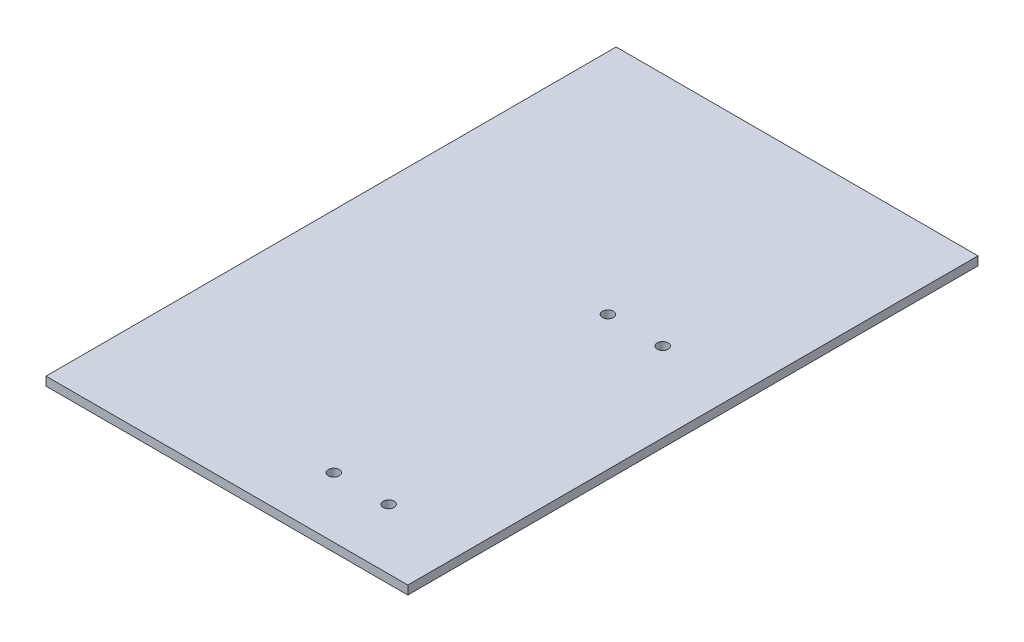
ISO-10303-21;
HEADER;
FILE_DESCRIPTION(('STEP AP214'),'2;1');
FILE_NAME('part.step','',(''),(''),'','','');
FILE_SCHEMA(('AUTOMOTIVE_DESIGN { 1 0 10303 214 1 1 1 1 }'));
ENDSEC;
DATA;
#1=APPLICATION_CONTEXT('core data for automotive mechanical design processes');
#2=APPLICATION_PROTOCOL_DEFINITION('international standard','automotive_design',2000,#1);
#3=PRODUCT_CONTEXT('',#1,'mechanical');
#4=PRODUCT('Part','Part','',(#3));
#5=PRODUCT_RELATED_PRODUCT_CATEGORY('part','',(#4));
#6=PRODUCT_DEFINITION_FORMATION('','',#4);
#7=PRODUCT_DEFINITION_CONTEXT('part definition',#1,'design');
#8=PRODUCT_DEFINITION('design','',#6,#7);
#9=PRODUCT_DEFINITION_SHAPE('','',#8);
#10=(LENGTH_UNIT() NAMED_UNIT(*) SI_UNIT(.MILLI.,.METRE.));
#11=(NAMED_UNIT(*) PLANE_ANGLE_UNIT() SI_UNIT($,.RADIAN.));
#12=(NAMED_UNIT(*) SI_UNIT($,.STERADIAN.) SOLID_ANGLE_UNIT());
#13=UNCERTAINTY_MEASURE_WITH_UNIT(LENGTH_MEASURE(1.E-05),#10,'distance_accuracy_value','');
#14=(GEOMETRIC_REPRESENTATION_CONTEXT(3) GLOBAL_UNCERTAINTY_ASSIGNED_CONTEXT((#13)) GLOBAL_UNIT_ASSIGNED_CONTEXT((#10,
#11,#12)) REPRESENTATION_CONTEXT('',''));
#15=CARTESIAN_POINT('',(0.,0.,0.));
#16=DIRECTION('',(0.,0.,1.));
#17=DIRECTION('',(1.,0.,0.));
#18=AXIS2_PLACEMENT_3D('',#15,#16,#17);
#19=CARTESIAN_POINT('',(33.,1.5875,52.));
#20=DIRECTION('',(-1.,0.,0.));
#21=DIRECTION('',(0.,0.,1.));
#22=AXIS2_PLACEMENT_3D('',#19,#20,#21);
#23=PLANE('',#22);
#24=DIRECTION('',(0.,0.,-1.));
#25=VECTOR('',#24,1.);
#26=CARTESIAN_POINT('',(33.,0.,52.));
#27=LINE('',#26,#25);
#28=CARTESIAN_POINT('',(33.,0.,52.));
#29=VERTEX_POINT('',#28);
#30=CARTESIAN_POINT('',(33.,0.,-52.));
#31=VERTEX_POINT('',#30);
#32=EDGE_CURVE('E96',#29,#31,#27,.T.);
#33=ORIENTED_EDGE('',*,*,#32,.T.);
#34=DIRECTION('',(0.,-1.,0.));
#35=VECTOR('',#34,1.);
#36=CARTESIAN_POINT('',(33.,1.5875,-52.));
#37=LINE('',#36,#35);
#38=CARTESIAN_POINT('',(33.,1.5875,-52.));
#39=VERTEX_POINT('',#38);
#40=EDGE_CURVE('E11',#39,#31,#37,.T.);
#41=ORIENTED_EDGE('',*,*,#40,.F.);
#42=DIRECTION('',(0.,0.,-1.));
#43=VECTOR('',#42,1.);
#44=CARTESIAN_POINT('',(33.,1.5875,52.));
#45=LINE('',#44,#43);
#46=CARTESIAN_POINT('',(33.,1.5875,52.));
#47=VERTEX_POINT('',#46);
#48=EDGE_CURVE('E84',#47,#39,#45,.T.);
#49=ORIENTED_EDGE('',*,*,#48,.F.);
#50=DIRECTION('',(0.,-1.,0.));
#51=VECTOR('',#50,1.);
#52=CARTESIAN_POINT('',(33.,1.5875,52.));
#53=LINE('',#52,#51);
#54=EDGE_CURVE('E92',#47,#29,#53,.T.);
#55=ORIENTED_EDGE('',*,*,#54,.T.);
#56=EDGE_LOOP('',(#33,#41,#49,#55));
#57=FACE_BOUND('',#56,.T.);
#58=ADVANCED_FACE('F33',(#57),#23,.F.);
#59=CARTESIAN_POINT('',(-33.,1.5875,-52.));
#60=DIRECTION('',(0.,0.,1.));
#61=DIRECTION('',(1.,0.,0.));
#62=AXIS2_PLACEMENT_3D('',#59,#60,#61);
#63=PLANE('',#62);
#64=DIRECTION('',(-1.,0.,0.));
#65=VECTOR('',#64,1.);
#66=CARTESIAN_POINT('',(-33.,0.,-52.));
#67=LINE('',#66,#65);
#68=CARTESIAN_POINT('',(-33.,0.,-52.));
#69=VERTEX_POINT('',#68);
#70=EDGE_CURVE('E88',#31,#69,#67,.T.);
#71=ORIENTED_EDGE('',*,*,#70,.T.);
#72=DIRECTION('',(0.,-1.,0.));
#73=VECTOR('',#72,1.);
#74=CARTESIAN_POINT('',(-33.,1.5875,-52.));
#75=LINE('',#74,#73);
#76=CARTESIAN_POINT('',(-33.,1.5875,-52.));
#77=VERTEX_POINT('',#76);
#78=EDGE_CURVE('E41',#77,#69,#75,.T.);
#79=ORIENTED_EDGE('',*,*,#78,.F.);
#80=DIRECTION('',(-1.,0.,0.));
#81=VECTOR('',#80,1.);
#82=CARTESIAN_POINT('',(-33.,1.5875,-52.));
#83=LINE('',#82,#81);
#84=EDGE_CURVE('E79',#39,#77,#83,.T.);
#85=ORIENTED_EDGE('',*,*,#84,.F.);
#86=ORIENTED_EDGE('',*,*,#40,.T.);
#87=EDGE_LOOP('',(#71,#79,#85,#86));
#88=FACE_BOUND('',#87,.T.);
#89=ADVANCED_FACE('F87',(#88),#63,.F.);
#90=CARTESIAN_POINT('',(-33.,1.5875,52.));
#91=DIRECTION('',(1.,0.,0.));
#92=DIRECTION('',(0.,0.,-1.));
#93=AXIS2_PLACEMENT_3D('',#90,#91,#92);
#94=PLANE('',#93);
#95=DIRECTION('',(0.,0.,1.));
#96=VECTOR('',#95,1.);
#97=CARTESIAN_POINT('',(-33.,0.,52.));
#98=LINE('',#97,#96);
#99=CARTESIAN_POINT('',(-33.,0.,52.));
#100=VERTEX_POINT('',#99);
#101=EDGE_CURVE('E66',#69,#100,#98,.T.);
#102=ORIENTED_EDGE('',*,*,#101,.T.);
#103=DIRECTION('',(0.,-1.,0.));
#104=VECTOR('',#103,1.);
#105=CARTESIAN_POINT('',(-33.,1.5875,52.));
#106=LINE('',#105,#104);
#107=CARTESIAN_POINT('',(-33.,1.5875,52.));
#108=VERTEX_POINT('',#107);
#109=EDGE_CURVE('E89',#108,#100,#106,.T.);
#110=ORIENTED_EDGE('',*,*,#109,.F.);
#111=DIRECTION('',(0.,0.,1.));
#112=VECTOR('',#111,1.);
#113=CARTESIAN_POINT('',(-33.,1.5875,52.));
#114=LINE('',#113,#112);
#115=EDGE_CURVE('E82',#77,#108,#114,.T.);
#116=ORIENTED_EDGE('',*,*,#115,.F.);
#117=ORIENTED_EDGE('',*,*,#78,.T.);
#118=EDGE_LOOP('',(#102,#110,#116,#117));
#119=FACE_BOUND('',#118,.T.);
#120=ADVANCED_FACE('F90',(#119),#94,.F.);
#121=CARTESIAN_POINT('',(-33.,1.5875,52.));
#122=DIRECTION('',(0.,0.,-1.));
#123=DIRECTION('',(-1.,0.,0.));
#124=AXIS2_PLACEMENT_3D('',#121,#122,#123);
#125=PLANE('',#124);
#126=DIRECTION('',(1.,0.,0.));
#127=VECTOR('',#126,1.);
#128=CARTESIAN_POINT('',(-33.,0.,52.));
#129=LINE('',#128,#127);
#130=EDGE_CURVE('E72',#100,#29,#129,.T.);
#131=ORIENTED_EDGE('',*,*,#130,.T.);
#132=ORIENTED_EDGE('',*,*,#54,.F.);
#133=DIRECTION('',(1.,0.,0.));
#134=VECTOR('',#133,1.);
#135=CARTESIAN_POINT('',(-33.,1.5875,52.));
#136=LINE('',#135,#134);
#137=EDGE_CURVE('E49',#108,#47,#136,.T.);
#138=ORIENTED_EDGE('',*,*,#137,.F.);
#139=ORIENTED_EDGE('',*,*,#109,.T.);
#140=EDGE_LOOP('',(#131,#132,#138,#139));
#141=FACE_BOUND('',#140,.T.);
#142=ADVANCED_FACE('F104',(#141),#125,.F.);
#143=CARTESIAN_POINT('',(0.,1.5875,0.));
#144=DIRECTION('',(0.,-1.,0.));
#145=DIRECTION('',(0.,0.,-1.));
#146=AXIS2_PLACEMENT_3D('',#143,#144,#145);
#147=PLANE('',#146);
#148=CARTESIAN_POINT('',(18.5,1.5875,41.));
#149=DIRECTION('',(0.,1.,0.));
#150=DIRECTION('',(0.,0.,1.));
#151=AXIS2_PLACEMENT_3D('',#148,#149,#150);
#152=CIRCLE('',#151,1.);
#153=CARTESIAN_POINT('',(18.5,1.5875,42.));
#154=VERTEX_POINT('',#153);
#155=EDGE_CURVE('E125',#154,#154,#152,.T.);
#156=ORIENTED_EDGE('',*,*,#155,.F.);
#157=EDGE_LOOP('',(#156));
#158=FACE_BOUND('',#157,.T.);
#159=CARTESIAN_POINT('',(8.50000000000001,1.5875,41.));
#160=DIRECTION('',(0.,1.,0.));
#161=DIRECTION('',(0.,0.,1.));
#162=AXIS2_PLACEMENT_3D('',#159,#160,#161);
#163=CIRCLE('',#162,1.);
#164=CARTESIAN_POINT('',(8.50000000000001,1.5875,42.));
#165=VERTEX_POINT('',#164);
#166=EDGE_CURVE('E119',#165,#165,#163,.T.);
#167=ORIENTED_EDGE('',*,*,#166,.F.);
#168=EDGE_LOOP('',(#167));
#169=FACE_BOUND('',#168,.T.);
#170=CARTESIAN_POINT('',(18.5,1.5875,-9.));
#171=DIRECTION('',(0.,1.,0.));
#172=DIRECTION('',(0.,0.,1.));
#173=AXIS2_PLACEMENT_3D('',#170,#171,#172);
#174=CIRCLE('',#173,1.);
#175=CARTESIAN_POINT('',(18.5,1.5875,-8.));
#176=VERTEX_POINT('',#175);
#177=EDGE_CURVE('E113',#176,#176,#174,.T.);
#178=ORIENTED_EDGE('',*,*,#177,.F.);
#179=EDGE_LOOP('',(#178));
#180=FACE_BOUND('',#179,.T.);
#181=CARTESIAN_POINT('',(8.50000000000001,1.5875,-8.99999999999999));
#182=DIRECTION('',(0.,1.,0.));
#183=DIRECTION('',(0.,0.,1.));
#184=AXIS2_PLACEMENT_3D('',#181,#182,#183);
#185=CIRCLE('',#184,1.);
#186=CARTESIAN_POINT('',(8.50000000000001,1.5875,-7.99999999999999));
#187=VERTEX_POINT('',#186);
#188=EDGE_CURVE('E110',#187,#187,#185,.T.);
#189=ORIENTED_EDGE('',*,*,#188,.F.);
#190=EDGE_LOOP('',(#189));
#191=FACE_BOUND('',#190,.T.);
#192=ORIENTED_EDGE('',*,*,#48,.T.);
#193=ORIENTED_EDGE('',*,*,#84,.T.);
#194=ORIENTED_EDGE('',*,*,#115,.T.);
#195=ORIENTED_EDGE('',*,*,#137,.T.);
#196=EDGE_LOOP('',(#192,#193,#194,#195));
#197=FACE_BOUND('',#196,.T.);
#198=ADVANCED_FACE('F80',(#158,#169,#180,#191,#197),#147,.F.);
#199=CARTESIAN_POINT('',(0.,0.,0.));
#200=DIRECTION('',(0.,-1.,0.));
#201=DIRECTION('',(0.,0.,-1.));
#202=AXIS2_PLACEMENT_3D('',#199,#200,#201);
#203=PLANE('',#202);
#204=CARTESIAN_POINT('',(18.5,0.,41.));
#205=DIRECTION('',(0.,1.,0.));
#206=DIRECTION('',(0.,0.,1.));
#207=AXIS2_PLACEMENT_3D('',#204,#205,#206);
#208=CIRCLE('',#207,1.);
#209=CARTESIAN_POINT('',(18.5,0.,42.));
#210=VERTEX_POINT('',#209);
#211=EDGE_CURVE('E128',#210,#210,#208,.T.);
#212=ORIENTED_EDGE('',*,*,#211,.T.);
#213=EDGE_LOOP('',(#212));
#214=FACE_BOUND('',#213,.T.);
#215=CARTESIAN_POINT('',(8.50000000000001,0.,41.));
#216=DIRECTION('',(0.,1.,0.));
#217=DIRECTION('',(0.,0.,1.));
#218=AXIS2_PLACEMENT_3D('',#215,#216,#217);
#219=CIRCLE('',#218,1.);
#220=CARTESIAN_POINT('',(8.50000000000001,0.,42.));
#221=VERTEX_POINT('',#220);
#222=EDGE_CURVE('E122',#221,#221,#219,.T.);
#223=ORIENTED_EDGE('',*,*,#222,.T.);
#224=EDGE_LOOP('',(#223));
#225=FACE_BOUND('',#224,.T.);
#226=CARTESIAN_POINT('',(18.5,0.,-9.));
#227=DIRECTION('',(0.,1.,0.));
#228=DIRECTION('',(0.,0.,1.));
#229=AXIS2_PLACEMENT_3D('',#226,#227,#228);
#230=CIRCLE('',#229,1.);
#231=CARTESIAN_POINT('',(18.5,0.,-8.));
#232=VERTEX_POINT('',#231);
#233=EDGE_CURVE('E116',#232,#232,#230,.T.);
#234=ORIENTED_EDGE('',*,*,#233,.T.);
#235=EDGE_LOOP('',(#234));
#236=FACE_BOUND('',#235,.T.);
#237=CARTESIAN_POINT('',(8.50000000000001,0.,-8.99999999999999));
#238=DIRECTION('',(0.,1.,0.));
#239=DIRECTION('',(0.,0.,1.));
#240=AXIS2_PLACEMENT_3D('',#237,#238,#239);
#241=CIRCLE('',#240,1.);
#242=CARTESIAN_POINT('',(8.50000000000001,0.,-7.99999999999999));
#243=VERTEX_POINT('',#242);
#244=EDGE_CURVE('E99',#243,#243,#241,.T.);
#245=ORIENTED_EDGE('',*,*,#244,.T.);
#246=EDGE_LOOP('',(#245));
#247=FACE_BOUND('',#246,.T.);
#248=ORIENTED_EDGE('',*,*,#32,.F.);
#249=ORIENTED_EDGE('',*,*,#130,.F.);
#250=ORIENTED_EDGE('',*,*,#101,.F.);
#251=ORIENTED_EDGE('',*,*,#70,.F.);
#252=EDGE_LOOP('',(#248,#249,#250,#251));
#253=FACE_BOUND('',#252,.T.);
#254=ADVANCED_FACE('F107',(#214,#225,#236,#247,#253),#203,.T.);
#255=CARTESIAN_POINT('',(8.50000000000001,0.,-8.99999999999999));
#256=DIRECTION('',(0.,1.,0.));
#257=DIRECTION('',(0.,0.,1.));
#258=AXIS2_PLACEMENT_3D('',#255,#256,#257);
#259=CYLINDRICAL_SURFACE('',#258,1.);
#260=ORIENTED_EDGE('',*,*,#244,.F.);
#261=EDGE_LOOP('',(#260));
#262=FACE_BOUND('',#261,.T.);
#263=ORIENTED_EDGE('',*,*,#188,.T.);
#264=EDGE_LOOP('',(#263));
#265=FACE_BOUND('',#264,.T.);
#266=ADVANCED_FACE('F145',(#262,#265),#259,.F.);
#267=CARTESIAN_POINT('',(18.5,0.,-9.));
#268=DIRECTION('',(0.,1.,0.));
#269=DIRECTION('',(0.,0.,1.));
#270=AXIS2_PLACEMENT_3D('',#267,#268,#269);
#271=CYLINDRICAL_SURFACE('',#270,1.);
#272=ORIENTED_EDGE('',*,*,#233,.F.);
#273=EDGE_LOOP('',(#272));
#274=FACE_BOUND('',#273,.T.);
#275=ORIENTED_EDGE('',*,*,#177,.T.);
#276=EDGE_LOOP('',(#275));
#277=FACE_BOUND('',#276,.T.);
#278=ADVANCED_FACE('F147',(#274,#277),#271,.F.);
#279=CARTESIAN_POINT('',(8.50000000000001,0.,41.));
#280=DIRECTION('',(0.,1.,0.));
#281=DIRECTION('',(0.,0.,1.));
#282=AXIS2_PLACEMENT_3D('',#279,#280,#281);
#283=CYLINDRICAL_SURFACE('',#282,1.);
#284=ORIENTED_EDGE('',*,*,#222,.F.);
#285=EDGE_LOOP('',(#284));
#286=FACE_BOUND('',#285,.T.);
#287=ORIENTED_EDGE('',*,*,#166,.T.);
#288=EDGE_LOOP('',(#287));
#289=FACE_BOUND('',#288,.T.);
#290=ADVANCED_FACE('F154',(#286,#289),#283,.F.);
#291=CARTESIAN_POINT('',(18.5,0.,41.));
#292=DIRECTION('',(0.,1.,0.));
#293=DIRECTION('',(0.,0.,1.));
#294=AXIS2_PLACEMENT_3D('',#291,#292,#293);
#295=CYLINDRICAL_SURFACE('',#294,1.);
#296=ORIENTED_EDGE('',*,*,#211,.F.);
#297=EDGE_LOOP('',(#296));
#298=FACE_BOUND('',#297,.T.);
#299=ORIENTED_EDGE('',*,*,#155,.T.);
#300=EDGE_LOOP('',(#299));
#301=FACE_BOUND('',#300,.T.);
#302=ADVANCED_FACE('F134',(#298,#301),#295,.F.);
#303=CLOSED_SHELL('',(#58,#89,#120,#142,#198,#254,#266,#278,#290,#302));
#304=MANIFOLD_SOLID_BREP('B2',#303);
#305=ADVANCED_BREP_SHAPE_REPRESENTATION('',(#18,#304),#14);
#306=SHAPE_DEFINITION_REPRESENTATION(#9,#305);
ENDSEC;
END-ISO-10303-21;
